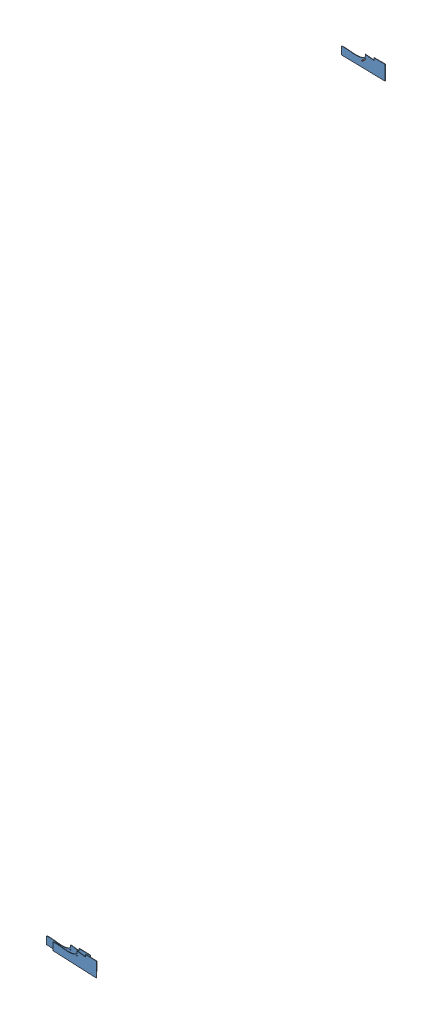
SolidWorks assembly PK2 - 17-01-03-02-00.SLDASM, configuration Domyślna (file format 7000). Lengths in mm.
Overall size (593.78 184.45 70).
12 component instances, 4 part files, 7 mates.
Components (placement in the parent):
- PK2 - 17-01-03-01-00-2: PK2 - 17-01-03-01-00.SLDASM [Domyślna] at (-2311.5609 46.6323 -12140.7562) size (488.38 165 40)
  - PK2 - 17-01-03-01-1: PK2 - 17-01-03-01.SLDPRT [Domyślna] at (19.6949 -66.454 -2) size (488.38 165 4)
  - PK2 - 17-01-03-02-3: PK2 - 17-01-03-02.SLDPRT [Domyślna] at (19.8096 58.4182 -2) size (10 10 40) (hidden)
- PK2 - 17-01-01-01-1: PK2 - 17-01-01-01.SLDPRT [Domyślna] at (-2195.4099 188.0357 -12351.7562) x (1 0 0) z (0 -1 0) (suppressed, hidden)
- PK2 - 17-01-01-01-3: PK2 - 17-01-01-01.SLDPRT [Domyślna] at (-2195.4099 172 -12337.7562) x (1 0 0) z (0 -1 0) (suppressed, hidden)
- PK2 - 17-01-04-01 - pomocniczy-1: PK2 - 17-01-04-01 - pomocniczy.SLDPRT [Domyślna] at (0 0 -11.7764) x (1 0 0) z (0 -1 0) (suppressed, hidden)
- PK2 - 17-01-03-01-00-6: PK2 - 17-01-03-01-00.SLDASM [Domyślna] at (1951.9829 -2704.9711 -4559.4118) x (0.999707 -0.024189 0) z (0 0 1) size (488.38 165 40)
  - PK2 - 17-01-03-01-1: PK2 - 17-01-03-01.SLDPRT [Domyślna] at (19.6949 -66.454 -2) size (488.38 165 4)
  - PK2 - 17-01-03-02-3: PK2 - 17-01-03-02.SLDPRT [Domyślna] at (19.8096 58.4182 -2) size (10 10 40) (hidden)
- PK2 - 17-01-03-01-00-7: PK2 - 17-01-03-01-00.SLDASM [Domyślna] at (2053.5407 -2697.2901 -4529.4118) x (0.999707 -0.024189 0) z (0 0 1) size (488.38 165 40)
  - PK2 - 17-01-03-01-1: PK2 - 17-01-03-01.SLDPRT [Domyślna] at (19.6949 -66.454 -2) size (488.38 165 4)
  - PK2 - 17-01-03-02-3: PK2 - 17-01-03-02.SLDPRT [Domyślna] at (19.8096 58.4182 -2) size (10 10 40) (hidden)
Mates (geometry in assembly coordinates):
- Równolegle4: parallel aligned: plane of PK2 - 17-01-04-01 - pomocniczy-1 through (0 -1 0) normal (-1 0 0); plane of PK2 - 17-01-03-01-00-6/PK2 - 17-01-03-01-1 through (1783.2314 -2569.2825 -4319.4305) normal (-1 0 0)
- Wspólnie6: coincident aligned: plane of PK2 - 17-01-04-01 - pomocniczy-1 through (0 0 -11.7764) normal (0 1 0); plane of assembly through (0 0 0) normal (0 1 0)
- Wspólnie7: coincident anti-aligned: plane of PK2 - 17-01-04-01 - pomocniczy-1 through (0 -1 0) normal (-1 0 0); plane of assembly through (0 0 0) normal (1 0 0)
- Wspólnie8: coincident aligned: plane of PK2 - 17-01-04-01 - pomocniczy-1 through (0 -1 0) normal (0 0 1); plane of assembly through (0 0 0) normal (0 0 1)
- Odległość1: distance = 30 mm aligned: plane of PK2 - 17-01-03-01-00-7/PK2 - 17-01-03-01-1 through (1947.79 -2650.5527 -4527.4118) normal (0 0 1); plane of PK2 - 17-01-03-01-00-6/PK2 - 17-01-03-01-1 through (1846.2322 -2658.2338 -4557.4118) normal (0 0 1)
- Równolegle7: parallel aligned: plane of PK2 - 17-01-03-01-00-6/PK2 - 17-01-03-01-1 through (1706.0254 -2734.6226 -4557.4118) normal (-0.046871 -0.998901 0); plane of PK2 - 17-01-03-01-00-7/PK2 - 17-01-03-01-1 through (1807.5833 -2726.9415 -4527.4118) normal (-0.046871 -0.998901 0)
- Stycznie5: tangent: cylinder of PK2 - 17-01-03-01-00-6/PK2 - 17-01-03-02-3 through (1973.1997 -2647.0491 -4521.4118) axis (0 0 -1) radius 5; face of PK2 - 17-01-03-01-00-7/PK2 - 17-01-03-01-1
